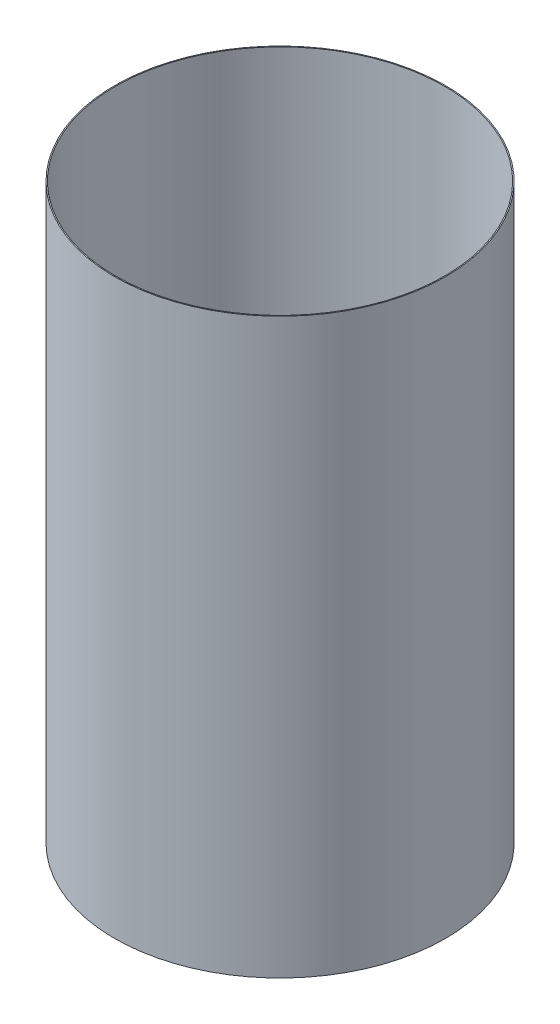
ISO-10303-21;
HEADER;
FILE_DESCRIPTION(('STEP AP214'),'2;1');
FILE_NAME('part.step','',(''),(''),'','','');
FILE_SCHEMA(('AUTOMOTIVE_DESIGN { 1 0 10303 214 1 1 1 1 }'));
ENDSEC;
DATA;
#1=APPLICATION_CONTEXT('core data for automotive mechanical design processes');
#2=APPLICATION_PROTOCOL_DEFINITION('international standard','automotive_design',2000,#1);
#3=PRODUCT_CONTEXT('',#1,'mechanical');
#4=PRODUCT('Part','Part','',(#3));
#5=PRODUCT_RELATED_PRODUCT_CATEGORY('part','',(#4));
#6=PRODUCT_DEFINITION_FORMATION('','',#4);
#7=PRODUCT_DEFINITION_CONTEXT('part definition',#1,'design');
#8=PRODUCT_DEFINITION('design','',#6,#7);
#9=PRODUCT_DEFINITION_SHAPE('','',#8);
#10=(LENGTH_UNIT() NAMED_UNIT(*) SI_UNIT(.MILLI.,.METRE.));
#11=(NAMED_UNIT(*) PLANE_ANGLE_UNIT() SI_UNIT($,.RADIAN.));
#12=(NAMED_UNIT(*) SI_UNIT($,.STERADIAN.) SOLID_ANGLE_UNIT());
#13=UNCERTAINTY_MEASURE_WITH_UNIT(LENGTH_MEASURE(1.E-05),#10,'distance_accuracy_value','');
#14=(GEOMETRIC_REPRESENTATION_CONTEXT(3) GLOBAL_UNCERTAINTY_ASSIGNED_CONTEXT((#13)) GLOBAL_UNIT_ASSIGNED_CONTEXT((#10,
#11,#12)) REPRESENTATION_CONTEXT('',''));
#15=CARTESIAN_POINT('',(0.,0.,0.));
#16=DIRECTION('',(0.,0.,1.));
#17=DIRECTION('',(1.,0.,0.));
#18=AXIS2_PLACEMENT_3D('',#15,#16,#17);
#19=CARTESIAN_POINT('',(0.,169.,0.));
#20=DIRECTION('',(0.,1.,0.));
#21=DIRECTION('',(0.,0.,1.));
#22=AXIS2_PLACEMENT_3D('',#19,#20,#21);
#23=PLANE('',#22);
#24=CARTESIAN_POINT('',(0.,169.,0.));
#25=DIRECTION('',(0.,1.,0.));
#26=DIRECTION('',(1.,0.,0.));
#27=AXIS2_PLACEMENT_3D('',#24,#25,#26);
#28=CIRCLE('',#27,48.8);
#29=CARTESIAN_POINT('',(48.8,169.,0.));
#30=VERTEX_POINT('',#29);
#31=EDGE_CURVE('E10',#30,#30,#28,.T.);
#32=ORIENTED_EDGE('',*,*,#31,.T.);
#33=EDGE_LOOP('',(#32));
#34=FACE_BOUND('',#33,.T.);
#35=CARTESIAN_POINT('',(0.,169.,0.));
#36=DIRECTION('',(0.,1.,0.));
#37=DIRECTION('',(0.,0.,1.));
#38=AXIS2_PLACEMENT_3D('',#35,#36,#37);
#39=CIRCLE('',#38,48.5);
#40=CARTESIAN_POINT('',(0.,169.,48.5));
#41=VERTEX_POINT('',#40);
#42=EDGE_CURVE('E40',#41,#41,#39,.T.);
#43=ORIENTED_EDGE('',*,*,#42,.F.);
#44=EDGE_LOOP('',(#43));
#45=FACE_BOUND('',#44,.T.);
#46=ADVANCED_FACE('F29',(#34,#45),#23,.T.);
#47=CARTESIAN_POINT('',(0.,0.,0.));
#48=DIRECTION('',(0.,1.,0.));
#49=DIRECTION('',(0.,0.,1.));
#50=AXIS2_PLACEMENT_3D('',#47,#48,#49);
#51=PLANE('',#50);
#52=CARTESIAN_POINT('',(0.,0.,0.));
#53=DIRECTION('',(0.,1.,0.));
#54=DIRECTION('',(1.,0.,0.));
#55=AXIS2_PLACEMENT_3D('',#52,#53,#54);
#56=CIRCLE('',#55,48.8);
#57=CARTESIAN_POINT('',(48.8,0.,0.));
#58=VERTEX_POINT('',#57);
#59=EDGE_CURVE('E36',#58,#58,#56,.T.);
#60=ORIENTED_EDGE('',*,*,#59,.F.);
#61=EDGE_LOOP('',(#60));
#62=FACE_BOUND('',#61,.T.);
#63=CARTESIAN_POINT('',(0.,0.,0.));
#64=DIRECTION('',(0.,1.,0.));
#65=DIRECTION('',(0.,0.,1.));
#66=AXIS2_PLACEMENT_3D('',#63,#64,#65);
#67=CIRCLE('',#66,48.5);
#68=CARTESIAN_POINT('',(0.,0.,48.5));
#69=VERTEX_POINT('',#68);
#70=EDGE_CURVE('E44',#69,#69,#67,.T.);
#71=ORIENTED_EDGE('',*,*,#70,.T.);
#72=EDGE_LOOP('',(#71));
#73=FACE_BOUND('',#72,.T.);
#74=ADVANCED_FACE('F50',(#62,#73),#51,.F.);
#75=CARTESIAN_POINT('',(0.,169.,0.));
#76=DIRECTION('',(0.,-1.,0.));
#77=DIRECTION('',(0.,0.,-1.));
#78=AXIS2_PLACEMENT_3D('',#75,#76,#77);
#79=CYLINDRICAL_SURFACE('',#78,48.8);
#80=ORIENTED_EDGE('',*,*,#31,.F.);
#81=EDGE_LOOP('',(#80));
#82=FACE_BOUND('',#81,.T.);
#83=ORIENTED_EDGE('',*,*,#59,.T.);
#84=EDGE_LOOP('',(#83));
#85=FACE_BOUND('',#84,.T.);
#86=ADVANCED_FACE('F31',(#82,#85),#79,.T.);
#87=CARTESIAN_POINT('',(0.,169.,0.));
#88=DIRECTION('',(0.,-1.,0.));
#89=DIRECTION('',(0.,0.,-1.));
#90=AXIS2_PLACEMENT_3D('',#87,#88,#89);
#91=CYLINDRICAL_SURFACE('',#90,48.5);
#92=ORIENTED_EDGE('',*,*,#42,.T.);
#93=EDGE_LOOP('',(#92));
#94=FACE_BOUND('',#93,.T.);
#95=ORIENTED_EDGE('',*,*,#70,.F.);
#96=EDGE_LOOP('',(#95));
#97=FACE_BOUND('',#96,.T.);
#98=ADVANCED_FACE('F52',(#94,#97),#91,.F.);
#99=CLOSED_SHELL('',(#46,#74,#86,#98));
#100=MANIFOLD_SOLID_BREP('B2',#99);
#101=ADVANCED_BREP_SHAPE_REPRESENTATION('',(#18,#100),#14);
#102=SHAPE_DEFINITION_REPRESENTATION(#9,#101);
ENDSEC;
END-ISO-10303-21;
